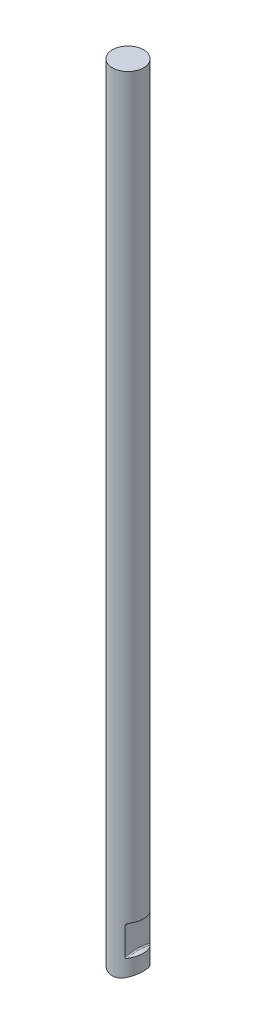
ISO-10303-21;
HEADER;
FILE_DESCRIPTION(('STEP AP214'),'2;1');
FILE_NAME('part.step','',(''),(''),'','','');
FILE_SCHEMA(('AUTOMOTIVE_DESIGN { 1 0 10303 214 1 1 1 1 }'));
ENDSEC;
DATA;
#1=APPLICATION_CONTEXT('core data for automotive mechanical design processes');
#2=APPLICATION_PROTOCOL_DEFINITION('international standard','automotive_design',2000,#1);
#3=PRODUCT_CONTEXT('',#1,'mechanical');
#4=PRODUCT('Part','Part','',(#3));
#5=PRODUCT_RELATED_PRODUCT_CATEGORY('part','',(#4));
#6=PRODUCT_DEFINITION_FORMATION('','',#4);
#7=PRODUCT_DEFINITION_CONTEXT('part definition',#1,'design');
#8=PRODUCT_DEFINITION('design','',#6,#7);
#9=PRODUCT_DEFINITION_SHAPE('','',#8);
#10=(LENGTH_UNIT() NAMED_UNIT(*) SI_UNIT(.MILLI.,.METRE.));
#11=(NAMED_UNIT(*) PLANE_ANGLE_UNIT() SI_UNIT($,.RADIAN.));
#12=(NAMED_UNIT(*) SI_UNIT($,.STERADIAN.) SOLID_ANGLE_UNIT());
#13=UNCERTAINTY_MEASURE_WITH_UNIT(LENGTH_MEASURE(1.E-05),#10,'distance_accuracy_value','');
#14=(GEOMETRIC_REPRESENTATION_CONTEXT(3) GLOBAL_UNCERTAINTY_ASSIGNED_CONTEXT((#13)) GLOBAL_UNIT_ASSIGNED_CONTEXT((#10,
#11,#12)) REPRESENTATION_CONTEXT('',''));
#15=CARTESIAN_POINT('',(0.,0.,0.));
#16=DIRECTION('',(0.,0.,1.));
#17=DIRECTION('',(1.,0.,0.));
#18=AXIS2_PLACEMENT_3D('',#15,#16,#17);
#19=CARTESIAN_POINT('',(3.762,0.,0.));
#20=DIRECTION('',(1.,0.,0.));
#21=DIRECTION('',(0.,0.,-1.));
#22=AXIS2_PLACEMENT_3D('',#19,#20,#21);
#23=TOROIDAL_SURFACE('',#22,23.738,0.762);
#24=CARTESIAN_POINT('',(3.0388592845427,23.159873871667,3.97055843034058));
#25=CARTESIAN_POINT('',(3.03333975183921,23.1760017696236,3.97478226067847));
#26=CARTESIAN_POINT('',(3.02838607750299,23.1924313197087,3.97855591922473));
#27=CARTESIAN_POINT('',(3.01964656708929,23.2257716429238,3.98519326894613));
#28=CARTESIAN_POINT('',(3.01586034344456,23.2426822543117,3.98805726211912));
#29=CARTESIAN_POINT('',(3.0063373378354,23.2937797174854,3.99524743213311));
#30=CARTESIAN_POINT('',(3.00237440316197,23.3285134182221,3.99821870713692));
#31=CARTESIAN_POINT('',(2.999213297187,23.3982545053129,4.00059027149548));
#32=CARTESIAN_POINT('',(3.00001116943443,23.4332616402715,3.99999352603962));
#33=CARTESIAN_POINT('',(3.00607576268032,23.5026797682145,3.99543765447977));
#34=CARTESIAN_POINT('',(3.0113463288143,23.5370902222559,3.99147563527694));
#35=CARTESIAN_POINT('',(3.0262367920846,23.6060418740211,3.98019860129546));
#36=CARTESIAN_POINT('',(3.03604236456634,23.6405187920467,3.97274023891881));
#37=CARTESIAN_POINT('',(3.05942064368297,23.7073154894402,3.95476445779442));
#38=CARTESIAN_POINT('',(3.07299456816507,23.7396345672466,3.9442460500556));
#39=CARTESIAN_POINT('',(3.10558877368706,23.8064503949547,3.9186488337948));
#40=CARTESIAN_POINT('',(3.12512499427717,23.8405213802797,3.90311809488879));
#41=CARTESIAN_POINT('',(3.16740170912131,23.9048519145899,3.86888986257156));
#42=CARTESIAN_POINT('',(3.19014416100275,23.9351091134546,3.85019043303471));
#43=CARTESIAN_POINT('',(3.24927153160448,24.0049923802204,3.80056981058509));
#44=CARTESIAN_POINT('',(3.28703729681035,24.0423200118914,3.76804015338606));
#45=CARTESIAN_POINT('',(3.36547276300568,24.108501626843,3.6981576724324));
#46=CARTESIAN_POINT('',(3.40614908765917,24.1373354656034,3.66079368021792));
#47=CARTESIAN_POINT('',(3.50091515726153,24.1942909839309,3.57057821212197));
#48=CARTESIAN_POINT('',(3.55540550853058,24.2196657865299,3.5164197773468));
#49=CARTESIAN_POINT('',(3.66367085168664,24.2581231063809,3.40347447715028));
#50=CARTESIAN_POINT('',(3.71744648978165,24.271217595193,3.34469218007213));
#51=CARTESIAN_POINT('',(3.78262610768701,24.2806399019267,3.26988003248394));
#52=CARTESIAN_POINT('',(3.79513761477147,24.282144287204,3.25535136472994));
#53=CARTESIAN_POINT('',(3.8075704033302,24.2833433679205,3.24074183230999));
#54=B_SPLINE_CURVE_WITH_KNOTS('',3,(#24,#25,#26,#27,#28,#29,#30,#31,#32,#33,#34,#35,#36,#37,#38,
#39,#40,#41,#42,#43,#44,#45,#46,#47,#48,#49,#50,#51,#52,#53),.UNSPECIFIED.,.F.,.F.,(4,2,2,2,2,2,
2,2,2,2,2,2,2,2,4),(0.,0.0526501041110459,0.105282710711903,0.209964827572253,0.314559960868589,
0.419245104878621,0.528658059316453,0.638106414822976,0.764334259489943,0.890639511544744,
1.07642718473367,1.26265200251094,1.50410161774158,1.7453156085,1.80299812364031),.UNSPECIFIED.);
#55=CARTESIAN_POINT('',(3.,23.3985607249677,4.));
#56=VERTEX_POINT('',#55);
#57=CARTESIAN_POINT('',(3.762,24.2776161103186,3.29353245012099));
#58=VERTEX_POINT('',#57);
#59=EDGE_CURVE('E168',#56,#58,#54,.T.);
#60=ORIENTED_EDGE('',*,*,#59,.F.);
#61=CARTESIAN_POINT('',(3.,0.,0.));
#62=DIRECTION('',(1.,0.,0.));
#63=DIRECTION('',(0.,0.,-1.));
#64=AXIS2_PLACEMENT_3D('',#61,#62,#63);
#65=CIRCLE('',#64,23.738);
#66=CARTESIAN_POINT('',(3.,23.3985607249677,-4.));
#67=VERTEX_POINT('',#66);
#68=EDGE_CURVE('E250',#67,#56,#65,.T.);
#69=ORIENTED_EDGE('',*,*,#68,.F.);
#70=CARTESIAN_POINT('',(3.8075704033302,24.2833433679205,-3.24074183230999));
#71=CARTESIAN_POINT('',(3.77940551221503,24.2806242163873,-3.27384144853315));
#72=CARTESIAN_POINT('',(3.7508528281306,24.2763420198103,-3.30650560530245));
#73=CARTESIAN_POINT('',(3.69316902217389,24.2644414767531,-3.37080962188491));
#74=CARTESIAN_POINT('',(3.66403687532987,24.2568166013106,-3.40244734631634));
#75=CARTESIAN_POINT('',(3.60523833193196,24.2379445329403,-3.46469457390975));
#76=CARTESIAN_POINT('',(3.57556948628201,24.2266651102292,-3.49529214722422));
#77=CARTESIAN_POINT('',(3.51634962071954,24.2002991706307,-3.55486270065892));
#78=CARTESIAN_POINT('',(3.48679851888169,24.1852160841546,-3.58383711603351));
#79=CARTESIAN_POINT('',(3.41688543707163,24.1443994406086,-3.65075944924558));
#80=CARTESIAN_POINT('',(3.37675896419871,24.1168025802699,-3.68784791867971));
#81=CARTESIAN_POINT('',(3.2992104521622,24.053485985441,-3.75738091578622));
#82=CARTESIAN_POINT('',(3.26177904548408,24.0177963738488,-3.7898419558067));
#83=CARTESIAN_POINT('',(3.19827205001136,23.9457666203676,-3.84349375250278));
#84=CARTESIAN_POINT('',(3.17139439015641,23.9108592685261,-3.86565239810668));
#85=CARTESIAN_POINT('',(3.12199328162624,23.8358227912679,-3.90565840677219));
#86=CARTESIAN_POINT('',(3.09946754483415,23.7956964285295,-3.92350803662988));
#87=CARTESIAN_POINT('',(3.06371522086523,23.7182819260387,-3.9514647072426));
#88=CARTESIAN_POINT('',(3.04955193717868,23.6817196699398,-3.96237920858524));
#89=CARTESIAN_POINT('',(3.0261164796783,23.6061231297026,-3.98030631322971));
#90=CARTESIAN_POINT('',(3.01684285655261,23.5670895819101,-3.98732007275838));
#91=CARTESIAN_POINT('',(3.00395703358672,23.4872387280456,-3.99703767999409));
#92=CARTESIAN_POINT('',(3.00038859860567,23.4464100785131,-3.99970821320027));
#93=CARTESIAN_POINT('',(2.99967350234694,23.364677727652,-4.00024521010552));
#94=CARTESIAN_POINT('',(3.00251523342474,23.3237742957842,-3.99812035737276));
#95=CARTESIAN_POINT('',(3.01186195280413,23.2624416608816,-3.99107767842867));
#96=CARTESIAN_POINT('',(3.0160205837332,23.2414163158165,-3.98793957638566));
#97=CARTESIAN_POINT('',(3.02611864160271,23.2000661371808,-3.98028190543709));
#98=CARTESIAN_POINT('',(3.03205732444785,23.1797410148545,-3.97576291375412));
#99=CARTESIAN_POINT('',(3.0388592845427,23.159873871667,-3.97055843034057));
#100=B_SPLINE_CURVE_WITH_KNOTS('',3,(#70,#71,#72,#73,#74,#75,#76,#77,#78,#79,#80,#81,#82,#83,
#84,#85,#86,#87,#88,#89,#90,#91,#92,#93,#94,#95,#96,#97,#98,#99),.UNSPECIFIED.,.F.,.F.,(4,2,2,2,
2,2,2,2,2,2,2,2,2,2,4),(0.,0.130631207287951,0.261518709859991,0.393593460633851,
0.525549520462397,0.708501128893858,0.890782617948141,1.03816490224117,1.18546948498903,
1.30707871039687,1.42865187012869,1.55115322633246,1.6734329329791,1.73830126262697,
1.80314251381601),.UNSPECIFIED.);
#101=CARTESIAN_POINT('',(3.76200000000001,24.2776161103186,-3.293532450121));
#102=VERTEX_POINT('',#101);
#103=EDGE_CURVE('E152',#102,#67,#100,.T.);
#104=ORIENTED_EDGE('',*,*,#103,.F.);
#105=CARTESIAN_POINT('',(3.762,0.,0.));
#106=DIRECTION('',(1.,0.,0.));
#107=DIRECTION('',(0.,0.,-1.));
#108=AXIS2_PLACEMENT_3D('',#105,#106,#107);
#109=CIRCLE('',#108,24.5);
#110=EDGE_CURVE('E247',#58,#102,#109,.F.);
#111=ORIENTED_EDGE('',*,*,#110,.F.);
#112=EDGE_LOOP('',(#60,#69,#104,#111));
#113=FACE_BOUND('',#112,.T.);
#114=ADVANCED_FACE('F38',(#113),#23,.F.);
#115=CARTESIAN_POINT('',(-8.84822894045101,0.,0.));
#116=DIRECTION('',(-1.,0.,0.));
#117=DIRECTION('',(0.,0.,1.));
#118=AXIS2_PLACEMENT_3D('',#115,#116,#117);
#119=CYLINDRICAL_SURFACE('',#118,24.5);
#120=ORIENTED_EDGE('',*,*,#110,.T.);
#121=CARTESIAN_POINT('',(3.762,24.2776161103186,-3.29353245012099));
#122=CARTESIAN_POINT('',(3.8539910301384,24.291872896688,-3.18847625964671));
#123=CARTESIAN_POINT('',(3.94157437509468,24.30595305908,-3.07953574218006));
#124=CARTESIAN_POINT('',(4.1073669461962,24.3333875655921,-2.85464858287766));
#125=CARTESIAN_POINT('',(4.18557579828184,24.3467418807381,-2.73870166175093));
#126=CARTESIAN_POINT('',(4.33205774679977,24.3723517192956,-2.50056534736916));
#127=CARTESIAN_POINT('',(4.40033022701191,24.3846071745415,-2.37837556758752));
#128=CARTESIAN_POINT('',(4.52643812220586,24.4076790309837,-2.12859756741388));
#129=CARTESIAN_POINT('',(4.58427390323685,24.4184954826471,-2.00100953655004));
#130=CARTESIAN_POINT('',(4.68911932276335,24.4383957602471,-1.74120612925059));
#131=CARTESIAN_POINT('',(4.73612010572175,24.4474781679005,-1.60898706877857));
#132=CARTESIAN_POINT('',(4.81888610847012,24.463646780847,-1.34090381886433));
#133=CARTESIAN_POINT('',(4.85464719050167,24.470732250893,-1.20503830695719));
#134=CARTESIAN_POINT('',(4.9145966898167,24.4826958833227,-0.930816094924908));
#135=CARTESIAN_POINT('',(4.93879601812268,24.4875761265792,-0.792461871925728));
#136=CARTESIAN_POINT('',(4.97548170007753,24.4950014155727,-0.51409747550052));
#137=CARTESIAN_POINT('',(4.98796404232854,24.497545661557,-0.374086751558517));
#138=CARTESIAN_POINT('',(5.00100997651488,24.50020532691,-0.0953827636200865));
#139=CARTESIAN_POINT('',(5.00173207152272,24.5003530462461,0.0433027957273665));
#140=CARTESIAN_POINT('',(4.9916576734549,24.4982983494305,0.32023730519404));
#141=CARTESIAN_POINT('',(4.98086121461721,24.4960959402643,0.458486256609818));
#142=CARTESIAN_POINT('',(4.94782509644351,24.4893999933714,0.733649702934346));
#143=CARTESIAN_POINT('',(4.92557757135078,24.4849048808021,0.87056321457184));
#144=CARTESIAN_POINT('',(4.86982120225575,24.4737494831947,1.14193842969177));
#145=CARTESIAN_POINT('',(4.8363161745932,24.4670899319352,1.27640094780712));
#146=CARTESIAN_POINT('',(4.75843478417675,24.4518148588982,1.54153344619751));
#147=CARTESIAN_POINT('',(4.71409517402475,24.4432059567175,1.6722146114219));
#148=CARTESIAN_POINT('',(4.61483875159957,24.4242577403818,1.92931170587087));
#149=CARTESIAN_POINT('',(4.55992575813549,24.4139190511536,2.05572915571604));
#150=CARTESIAN_POINT('',(4.43998004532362,24.3918009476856,2.30336427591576));
#151=CARTESIAN_POINT('',(4.37495815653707,24.3800230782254,2.42458733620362));
#152=CARTESIAN_POINT('',(4.23523436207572,24.3553379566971,2.66113628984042));
#153=CARTESIAN_POINT('',(4.16053695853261,24.3424312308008,2.77646489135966));
#154=CARTESIAN_POINT('',(4.0315229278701,24.320788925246,2.95875648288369));
#155=CARTESIAN_POINT('',(3.97998199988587,24.31229091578,3.02773011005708));
#156=CARTESIAN_POINT('',(3.87351305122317,24.2950890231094,3.1627961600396));
#157=CARTESIAN_POINT('',(3.81859083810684,24.2863855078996,3.22889320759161));
#158=CARTESIAN_POINT('',(3.76200000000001,24.2776161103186,3.293532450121));
#159=B_SPLINE_CURVE_WITH_KNOTS('',3,(#121,#122,#123,#124,#125,#126,#127,#128,#129,#130,#131,
#132,#133,#134,#135,#136,#137,#138,#139,#140,#141,#142,#143,#144,#145,#146,#147,#148,#149,#150,
#151,#152,#153,#154,#155,#156,#157,#158),.UNSPECIFIED.,.F.,.F.,(4,2,2,2,2,2,2,2,2,2,2,2,2,2,2,2,
2,2,4),(0.,0.420975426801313,0.84196764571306,1.26298596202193,1.68398950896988,
2.10533593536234,2.52683729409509,2.94794008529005,3.36918699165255,3.78475161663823,
4.20031500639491,4.61616422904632,5.03187261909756,5.44618997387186,5.86035796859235,
6.27408524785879,6.68762070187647,6.94708129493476,7.20610805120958),.UNSPECIFIED.);
#160=EDGE_CURVE('E160',#102,#58,#159,.T.);
#161=ORIENTED_EDGE('',*,*,#160,.T.);
#162=EDGE_LOOP('',(#120,#161));
#163=FACE_BOUND('',#162,.T.);
#164=ADVANCED_FACE('F134',(#163),#119,.F.);
#165=CARTESIAN_POINT('',(3.381,0.,0.));
#166=DIRECTION('',(1.,0.,0.));
#167=DIRECTION('',(0.,0.,-1.));
#168=AXIS2_PLACEMENT_3D('',#165,#166,#167);
#169=TOROIDAL_SURFACE('',#168,15.381,0.381);
#170=CARTESIAN_POINT('',(3.40598849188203,14.5473491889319,3.66049756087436));
#171=CARTESIAN_POINT('',(3.38315920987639,14.5404821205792,3.68175481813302));
#172=CARTESIAN_POINT('',(3.35969097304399,14.5355589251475,3.70317811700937));
#173=CARTESIAN_POINT('',(3.31181743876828,14.5304449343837,3.74604835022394));
#174=CARTESIAN_POINT('',(3.28740463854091,14.5303071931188,3.76749291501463));
#175=CARTESIAN_POINT('',(3.24501266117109,14.5350705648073,3.80400582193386));
#176=CARTESIAN_POINT('',(3.22704805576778,14.5386421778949,3.81925401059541));
#177=CARTESIAN_POINT('',(3.19158276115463,14.5493353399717,3.84893863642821));
#178=CARTESIAN_POINT('',(3.17408054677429,14.5564431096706,3.86337798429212));
#179=CARTESIAN_POINT('',(3.14333064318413,14.5728882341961,3.88841741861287));
#180=CARTESIAN_POINT('',(3.12990088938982,14.5815569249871,3.89922949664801));
#181=CARTESIAN_POINT('',(3.10421754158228,14.6016141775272,3.91970696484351));
#182=CARTESIAN_POINT('',(3.09196394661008,14.6130027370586,3.9293723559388));
#183=CARTESIAN_POINT('',(3.06911138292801,14.6385326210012,3.94724816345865));
#184=CARTESIAN_POINT('',(3.05852593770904,14.6526945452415,3.95544675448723));
#185=CARTESIAN_POINT('',(3.03970578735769,14.6833648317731,3.9699283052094));
#186=CARTESIAN_POINT('',(3.03146919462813,14.6998712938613,3.97621280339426));
#187=CARTESIAN_POINT('',(3.01866613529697,14.7323180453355,3.98593914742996));
#188=CARTESIAN_POINT('',(3.01375910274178,14.7480464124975,3.98964642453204));
#189=CARTESIAN_POINT('',(3.00614664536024,14.7803165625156,3.99538549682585));
#190=CARTESIAN_POINT('',(3.00344114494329,14.796858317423,3.99741734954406));
#191=CARTESIAN_POINT('',(3.00022654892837,14.8300894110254,3.99983056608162));
#192=CARTESIAN_POINT('',(2.99969511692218,14.8467754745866,4.00022871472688));
#193=CARTESIAN_POINT('',(3.00063469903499,14.8800524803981,3.99952391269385));
#194=CARTESIAN_POINT('',(3.00210618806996,14.8966433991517,3.99842060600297));
#195=CARTESIAN_POINT('',(3.00714220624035,14.9313393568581,3.99463474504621));
#196=CARTESIAN_POINT('',(3.01093296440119,14.9493924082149,3.99178139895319));
#197=CARTESIAN_POINT('',(3.02047833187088,14.9846532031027,3.98456348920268));
#198=CARTESIAN_POINT('',(3.0262343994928,15.0018603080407,3.98019780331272));
#199=CARTESIAN_POINT('',(3.04243829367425,15.0428505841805,3.96783502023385));
#200=CARTESIAN_POINT('',(3.05382776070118,15.0660398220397,3.95909035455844));
#201=CARTESIAN_POINT('',(3.0793422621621,15.1097719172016,3.93927817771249));
#202=CARTESIAN_POINT('',(3.0934721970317,15.1303099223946,3.92820650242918));
#203=CARTESIAN_POINT('',(3.12756592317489,15.173305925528,3.90114257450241));
#204=CARTESIAN_POINT('',(3.14810611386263,15.194967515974,3.88461163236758));
#205=CARTESIAN_POINT('',(3.19133924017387,15.2337047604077,3.84917350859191));
#206=CARTESIAN_POINT('',(3.2140343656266,15.2507756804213,3.83026390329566));
#207=CARTESIAN_POINT('',(3.26103377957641,15.280455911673,3.79033270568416));
#208=CARTESIAN_POINT('',(3.28535444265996,15.2930076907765,3.76928797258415));
#209=CARTESIAN_POINT('',(3.33463108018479,15.313286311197,3.72576317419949));
#210=CARTESIAN_POINT('',(3.35958569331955,15.3210227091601,3.70328605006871));
#211=CARTESIAN_POINT('',(3.39170627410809,15.3278056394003,3.6737480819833));
#212=CARTESIAN_POINT('',(3.39885009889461,15.3291125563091,3.66714013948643));
#213=CARTESIAN_POINT('',(3.4059884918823,15.3302166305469,3.66049756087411));
#214=B_SPLINE_CURVE_WITH_KNOTS('',3,(#170,#171,#172,#173,#174,#175,#176,#177,#178,#179,#180,
#181,#182,#183,#184,#185,#186,#187,#188,#189,#190,#191,#192,#193,#194,#195,#196,#197,#198,#199,
#200,#201,#202,#203,#204,#205,#206,#207,#208,#209,#210,#211,#212,#213),.UNSPECIFIED.,.F.,.F.,(4,
2,2,2,2,2,2,2,2,2,2,2,2,2,2,2,2,2,2,2,2,4),(0.,0.0959972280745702,0.193058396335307,
0.26432258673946,0.335311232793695,0.392978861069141,0.450646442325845,0.508759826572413,
0.566826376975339,0.617242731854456,0.667657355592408,0.717552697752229,0.767459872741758,
0.823248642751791,0.879078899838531,0.96045715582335,1.04198229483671,1.14381807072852,
1.24575846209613,1.34895421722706,1.45194451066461,1.48139123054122),.UNSPECIFIED.);
#215=CARTESIAN_POINT('',(3.381,14.5406726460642,3.68359050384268));
#216=VERTEX_POINT('',#215);
#217=CARTESIAN_POINT('',(2.99999999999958,14.8517729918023,4.00000000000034));
#218=VERTEX_POINT('',#217);
#219=EDGE_CURVE('E12',#216,#218,#214,.T.);
#220=ORIENTED_EDGE('',*,*,#219,.F.);
#221=CARTESIAN_POINT('',(3.381,0.,0.));
#222=DIRECTION('',(1.,0.,0.));
#223=DIRECTION('',(0.,0.,-1.));
#224=AXIS2_PLACEMENT_3D('',#221,#222,#223);
#225=CIRCLE('',#224,15.);
#226=CARTESIAN_POINT('',(3.38100000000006,14.5406726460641,-3.68359050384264));
#227=VERTEX_POINT('',#226);
#228=EDGE_CURVE('E113',#227,#216,#225,.T.);
#229=ORIENTED_EDGE('',*,*,#228,.F.);
#230=CARTESIAN_POINT('',(3.40598849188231,15.3302166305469,-3.66049756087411));
#231=CARTESIAN_POINT('',(3.37748333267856,15.3257810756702,-3.68704479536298));
#232=CARTESIAN_POINT('',(3.34888610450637,15.3181530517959,-3.71300840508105));
#233=CARTESIAN_POINT('',(3.29221130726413,15.2965210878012,-3.76334260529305));
#234=CARTESIAN_POINT('',(3.26414100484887,15.2824587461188,-3.78769621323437));
#235=CARTESIAN_POINT('',(3.20989288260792,15.248119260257,-3.83377904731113));
#236=CARTESIAN_POINT('',(3.18370817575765,15.2278663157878,-3.85551804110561));
#237=CARTESIAN_POINT('',(3.13450705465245,15.1812486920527,-3.89562099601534));
#238=CARTESIAN_POINT('',(3.11147747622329,15.154910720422,-3.91399909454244));
#239=CARTESIAN_POINT('',(3.07749970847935,15.106724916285,-3.9407218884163));
#240=CARTESIAN_POINT('',(3.06514970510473,15.0865509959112,-3.950323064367));
#241=CARTESIAN_POINT('',(3.04307837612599,15.0439543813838,-3.96735018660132));
#242=CARTESIAN_POINT('',(3.03335431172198,15.0215340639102,-3.97477839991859));
#243=CARTESIAN_POINT('',(3.01874813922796,14.9792159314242,-3.9858785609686));
#244=CARTESIAN_POINT('',(3.01330070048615,14.9596300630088,-3.98999311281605));
#245=CARTESIAN_POINT('',(3.00502544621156,14.919599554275,-3.99622942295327));
#246=CARTESIAN_POINT('',(3.00219494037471,14.8991558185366,-3.99835322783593));
#247=CARTESIAN_POINT('',(2.9997373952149,14.8610221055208,-4.00019716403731));
#248=CARTESIAN_POINT('',(2.99969678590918,14.8433744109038,-4.00022761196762));
#249=CARTESIAN_POINT('',(3.00197163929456,14.808312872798,-3.9985207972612));
#250=CARTESIAN_POINT('',(3.00428592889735,14.7908989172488,-3.99678441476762));
#251=CARTESIAN_POINT('',(3.01134440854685,14.7567790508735,-3.99146893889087));
#252=CARTESIAN_POINT('',(3.01609843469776,14.740076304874,-3.98788238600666));
#253=CARTESIAN_POINT('',(3.02792922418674,14.7080341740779,-3.97890678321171));
#254=CARTESIAN_POINT('',(3.03500551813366,14.6926945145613,-3.97351809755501));
#255=CARTESIAN_POINT('',(3.05061829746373,14.6648808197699,-3.96154229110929));
#256=CARTESIAN_POINT('',(3.05901763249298,14.6522812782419,-3.95506567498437));
#257=CARTESIAN_POINT('',(3.07724252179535,14.6289375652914,-3.9409023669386));
#258=CARTESIAN_POINT('',(3.0870683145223,14.6181937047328,-3.93321547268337));
#259=CARTESIAN_POINT('',(3.10834437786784,14.5981530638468,-3.91642541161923));
#260=CARTESIAN_POINT('',(3.1198534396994,14.5889644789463,-3.90726847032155));
#261=CARTESIAN_POINT('',(3.14366903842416,14.5727565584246,-3.88813313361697));
#262=CARTESIAN_POINT('',(3.15597575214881,14.5657377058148,-3.87815455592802));
#263=CARTESIAN_POINT('',(3.18751176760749,14.5506786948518,-3.85231973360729));
#264=CARTESIAN_POINT('',(3.20705479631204,14.5439604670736,-3.83607339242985));
#265=CARTESIAN_POINT('',(3.24649882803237,14.5346519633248,-3.80275149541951));
#266=CARTESIAN_POINT('',(3.26640103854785,14.5320802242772,-3.78567256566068));
#267=CARTESIAN_POINT('',(3.30670448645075,14.530495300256,-3.75052571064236));
#268=CARTESIAN_POINT('',(3.32709789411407,14.5316135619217,-3.73244431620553));
#269=CARTESIAN_POINT('',(3.36712551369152,14.5371642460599,-3.69637610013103));
#270=CARTESIAN_POINT('',(3.386765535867,14.5415608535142,-3.67839035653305));
#271=CARTESIAN_POINT('',(3.40598849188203,14.5473491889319,-3.66049756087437));
#272=B_SPLINE_CURVE_WITH_KNOTS('',3,(#230,#231,#232,#233,#234,#235,#236,#237,#238,#239,#240,
#241,#242,#243,#244,#245,#246,#247,#248,#249,#250,#251,#252,#253,#254,#255,#256,#257,#258,#259,
#260,#261,#262,#263,#264,#265,#266,#267,#268,#269,#270,#271),.UNSPECIFIED.,.F.,.F.,(4,2,2,2,2,2,
2,2,2,2,2,2,2,2,2,2,2,2,2,2,4),(0.,0.117535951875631,0.236160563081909,0.354327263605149,
0.471984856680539,0.548301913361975,0.624539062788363,0.686524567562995,0.748446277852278,
0.801165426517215,0.853858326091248,0.906765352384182,0.959661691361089,1.008849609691,
1.05804576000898,1.10987437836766,1.16171452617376,1.24013789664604,1.31891089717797,
1.40051984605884,1.48125006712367),.UNSPECIFIED.);
#273=CARTESIAN_POINT('',(3.,14.8517729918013,-4.));
#274=VERTEX_POINT('',#273);
#275=EDGE_CURVE('E52',#274,#227,#272,.T.);
#276=ORIENTED_EDGE('',*,*,#275,.F.);
#277=CARTESIAN_POINT('',(3.,0.,0.));
#278=DIRECTION('',(1.,0.,0.));
#279=DIRECTION('',(0.,0.,-1.));
#280=AXIS2_PLACEMENT_3D('',#277,#278,#279);
#281=CIRCLE('',#280,15.381);
#282=EDGE_CURVE('E119',#218,#274,#281,.F.);
#283=ORIENTED_EDGE('',*,*,#282,.F.);
#284=EDGE_LOOP('',(#220,#229,#276,#283));
#285=FACE_BOUND('',#284,.T.);
#286=ADVANCED_FACE('F40',(#285),#169,.F.);
#287=CARTESIAN_POINT('',(-8.84822894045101,0.,0.));
#288=DIRECTION('',(-1.,0.,0.));
#289=DIRECTION('',(0.,0.,1.));
#290=AXIS2_PLACEMENT_3D('',#287,#288,#289);
#291=CYLINDRICAL_SURFACE('',#290,15.);
#292=ORIENTED_EDGE('',*,*,#228,.T.);
#293=CARTESIAN_POINT('',(3.381,14.5406726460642,3.68359050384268));
#294=CARTESIAN_POINT('',(3.48402834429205,14.5646307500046,3.58903687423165));
#295=CARTESIAN_POINT('',(3.58306636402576,14.5886933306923,3.49016026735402));
#296=CARTESIAN_POINT('',(3.7725728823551,14.6363888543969,3.28439294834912));
#297=CARTESIAN_POINT('',(3.86304038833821,14.6600217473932,3.17750131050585));
#298=CARTESIAN_POINT('',(4.03490626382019,14.706243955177,2.95621197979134));
#299=CARTESIAN_POINT('',(4.11629250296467,14.7288318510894,2.84180456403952));
#300=CARTESIAN_POINT('',(4.26928246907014,14.7723184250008,2.60632652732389));
#301=CARTESIAN_POINT('',(4.3408866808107,14.7932171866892,2.48525623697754));
#302=CARTESIAN_POINT('',(4.47386018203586,14.8327808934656,2.23705652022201));
#303=CARTESIAN_POINT('',(4.53521587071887,14.8514428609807,2.10991932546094));
#304=CARTESIAN_POINT('',(4.64709184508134,14.8859876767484,1.85053835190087));
#305=CARTESIAN_POINT('',(4.69760813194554,14.9018694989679,1.71829270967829));
#306=CARTESIAN_POINT('',(4.78726872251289,14.9303762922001,1.44984729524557));
#307=CARTESIAN_POINT('',(4.82642759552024,14.9430054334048,1.31365283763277));
#308=CARTESIAN_POINT('',(4.89310041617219,14.9646729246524,1.0381071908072));
#309=CARTESIAN_POINT('',(4.92061030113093,14.9737100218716,0.898754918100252));
#310=CARTESIAN_POINT('',(4.96296923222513,14.9876842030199,0.622717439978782));
#311=CARTESIAN_POINT('',(4.9782108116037,14.9927482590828,0.486098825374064));
#312=CARTESIAN_POINT('',(4.99739339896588,14.999128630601,0.211984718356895));
#313=CARTESIAN_POINT('',(5.00133453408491,15.0004449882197,0.0744892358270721));
#314=CARTESIAN_POINT('',(4.99787353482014,14.9992910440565,-0.20033833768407));
#315=CARTESIAN_POINT('',(4.99047242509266,14.9968210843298,-0.337670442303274));
#316=CARTESIAN_POINT('',(4.96441660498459,14.9881720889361,-0.611110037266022));
#317=CARTESIAN_POINT('',(4.9457619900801,14.9819930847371,-0.74721753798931));
#318=CARTESIAN_POINT('',(4.87450091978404,14.9585638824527,-1.14461455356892));
#319=CARTESIAN_POINT('',(4.80646557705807,14.9363677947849,-1.40301437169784));
#320=CARTESIAN_POINT('',(4.6306293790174,14.8807206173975,-1.9047399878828));
#321=CARTESIAN_POINT('',(4.52280140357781,14.8472618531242,-2.14805537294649));
#322=CARTESIAN_POINT('',(4.33076976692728,14.7902545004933,-2.50274951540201));
#323=CARTESIAN_POINT('',(4.25968604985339,14.769551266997,-2.6218840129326));
#324=CARTESIAN_POINT('',(4.10800408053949,14.7265203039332,-2.85367640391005));
#325=CARTESIAN_POINT('',(4.02740497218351,14.7041924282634,-2.96633371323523));
#326=CARTESIAN_POINT('',(3.85731962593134,14.6585200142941,-3.18436689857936));
#327=CARTESIAN_POINT('',(3.7678394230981,14.6351761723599,-3.28974763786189));
#328=CARTESIAN_POINT('',(3.58053540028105,14.5880784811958,-3.49268462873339));
#329=CARTESIAN_POINT('',(3.4827128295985,14.5643246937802,-3.59024204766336));
#330=CARTESIAN_POINT('',(3.381,14.5406726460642,-3.68359050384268));
#331=B_SPLINE_CURVE_WITH_KNOTS('',3,(#293,#294,#295,#296,#297,#298,#299,#300,#301,#302,#303,
#304,#305,#306,#307,#308,#309,#310,#311,#312,#313,#314,#315,#316,#317,#318,#319,#320,#321,#322,
#323,#324,#325,#326,#327,#328,#329,#330),.UNSPECIFIED.,.F.,.F.,(4,2,2,2,2,2,2,2,2,2,2,2,2,2,2,2,
2,2,4),(0.,0.425513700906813,0.851076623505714,1.27720135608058,1.70330496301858,
2.12996963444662,2.55679143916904,2.9830632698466,3.40948364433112,3.82164778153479,
4.23380728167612,4.64592954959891,5.0580483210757,5.8584905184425,6.65947925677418,
7.07986821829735,7.50029503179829,7.92043807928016,8.34051831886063),.UNSPECIFIED.);
#332=EDGE_CURVE('E107',#216,#227,#331,.T.);
#333=ORIENTED_EDGE('',*,*,#332,.T.);
#334=EDGE_LOOP('',(#292,#333));
#335=FACE_BOUND('',#334,.T.);
#336=ADVANCED_FACE('F116',(#335),#291,.T.);
#337=CARTESIAN_POINT('',(3.,15.,0.));
#338=DIRECTION('',(1.,0.,0.));
#339=DIRECTION('',(0.,0.,-1.));
#340=AXIS2_PLACEMENT_3D('',#337,#338,#339);
#341=PLANE('',#340);
#342=ORIENTED_EDGE('',*,*,#282,.T.);
#343=DIRECTION('',(0.,1.,0.));
#344=VECTOR('',#343,1.);
#345=CARTESIAN_POINT('',(3.,8.66025403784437,-4.));
#346=LINE('',#345,#344);
#347=EDGE_CURVE('E67',#274,#67,#346,.T.);
#348=ORIENTED_EDGE('',*,*,#347,.T.);
#349=ORIENTED_EDGE('',*,*,#68,.T.);
#350=DIRECTION('',(0.,1.,0.));
#351=VECTOR('',#350,1.);
#352=CARTESIAN_POINT('',(3.,8.66025403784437,4.));
#353=LINE('',#352,#351);
#354=EDGE_CURVE('E290',#56,#218,#353,.F.);
#355=ORIENTED_EDGE('',*,*,#354,.T.);
#356=EDGE_LOOP('',(#342,#348,#349,#355));
#357=FACE_BOUND('',#356,.T.);
#358=ADVANCED_FACE('F132',(#357),#341,.T.);
#359=CARTESIAN_POINT('',(0.,8.66025403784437,0.));
#360=DIRECTION('',(0.,1.,0.));
#361=DIRECTION('',(0.,0.,1.));
#362=AXIS2_PLACEMENT_3D('',#359,#360,#361);
#363=CYLINDRICAL_SURFACE('',#362,5.);
#364=CARTESIAN_POINT('',(0.,260.,0.));
#365=DIRECTION('',(0.,1.,0.));
#366=DIRECTION('',(0.,0.,1.));
#367=AXIS2_PLACEMENT_3D('',#364,#365,#366);
#368=CIRCLE('',#367,5.);
#369=CARTESIAN_POINT('',(0.,260.,5.));
#370=VERTEX_POINT('',#369);
#371=EDGE_CURVE('E117',#370,#370,#368,.T.);
#372=ORIENTED_EDGE('',*,*,#371,.F.);
#373=EDGE_LOOP('',(#372));
#374=FACE_BOUND('',#373,.T.);
#375=CARTESIAN_POINT('',(0.,8.66025403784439,5.));
#376=CARTESIAN_POINT('',(0.130331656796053,8.66025482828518,4.99999937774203));
#377=CARTESIAN_POINT('',(0.260674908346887,8.66320639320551,4.99489703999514));
#378=CARTESIAN_POINT('',(0.520355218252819,8.67490215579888,4.97455590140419));
#379=CARTESIAN_POINT('',(0.649691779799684,8.68364905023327,4.95931238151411));
#380=CARTESIAN_POINT('',(0.906513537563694,8.70662912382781,4.91885673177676));
#381=CARTESIAN_POINT('',(1.03399550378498,8.72087090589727,4.89362896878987));
#382=CARTESIAN_POINT('',(1.28601746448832,8.75432466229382,4.83352579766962));
#383=CARTESIAN_POINT('',(1.41055615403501,8.77353879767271,4.79864619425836));
#384=CARTESIAN_POINT('',(1.77711120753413,8.83745677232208,4.6805346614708));
#385=CARTESIAN_POINT('',(2.01373232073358,8.88859880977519,4.58356144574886));
#386=CARTESIAN_POINT('',(2.46716195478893,9.00213659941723,4.35632594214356));
#387=CARTESIAN_POINT('',(2.68396940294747,9.06453296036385,4.22606185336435));
#388=CARTESIAN_POINT('',(3.11151061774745,9.19984032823,3.92334549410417));
#389=CARTESIAN_POINT('',(3.32026858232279,9.27319410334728,3.74829976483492));
#390=CARTESIAN_POINT('',(3.70706905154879,9.41860822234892,3.36622943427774));
#391=CARTESIAN_POINT('',(3.8850962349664,9.49066790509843,3.15918897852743));
#392=CARTESIAN_POINT('',(4.1312264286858,9.59484443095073,2.82033206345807));
#393=CARTESIAN_POINT('',(4.2119131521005,9.62993554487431,2.69838192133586));
#394=CARTESIAN_POINT('',(4.36262866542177,9.69680156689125,2.44722131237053));
#395=CARTESIAN_POINT('',(4.43266169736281,9.72857779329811,2.31801376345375));
#396=CARTESIAN_POINT('',(4.56137623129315,9.78789520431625,2.05317391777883));
#397=CARTESIAN_POINT('',(4.62006065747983,9.81543747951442,1.91754328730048));
#398=CARTESIAN_POINT('',(4.72543101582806,9.86547242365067,1.64079696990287));
#399=CARTESIAN_POINT('',(4.77211822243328,9.88796562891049,1.49968186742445));
#400=CARTESIAN_POINT('',(4.85001551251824,9.92580359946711,1.22330436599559));
#401=CARTESIAN_POINT('',(4.88209010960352,9.94154295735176,1.08833937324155));
#402=CARTESIAN_POINT('',(4.93496642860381,9.96761571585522,0.815709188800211));
#403=CARTESIAN_POINT('',(4.95576924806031,9.97794964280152,0.678044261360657));
#404=CARTESIAN_POINT('',(4.98581991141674,9.99290900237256,0.401217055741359));
#405=CARTESIAN_POINT('',(4.99507333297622,9.99753719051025,0.262055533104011));
#406=CARTESIAN_POINT('',(5.00191433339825,10.0009568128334,-0.0166220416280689));
#407=CARTESIAN_POINT('',(4.99950262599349,9.99974860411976,-0.156138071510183));
#408=CARTESIAN_POINT('',(4.98376939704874,9.99189263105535,-0.422158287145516));
#409=CARTESIAN_POINT('',(4.97141822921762,9.9857287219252,-0.548735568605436));
#410=CARTESIAN_POINT('',(4.93716742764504,9.9687211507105,-0.80031234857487));
#411=CARTESIAN_POINT('',(4.91526477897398,9.95787601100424,-0.925311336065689));
#412=CARTESIAN_POINT('',(4.8621537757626,9.93176736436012,-1.17280363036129));
#413=CARTESIAN_POINT('',(4.83094853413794,9.91650533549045,-1.29529776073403));
#414=CARTESIAN_POINT('',(4.75955234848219,9.88192155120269,-1.53706747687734));
#415=CARTESIAN_POINT('',(4.71935796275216,9.86259824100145,-1.6563418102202));
#416=CARTESIAN_POINT('',(4.58462546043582,9.79859222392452,-2.01140340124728));
#417=CARTESIAN_POINT('',(4.4766310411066,9.74822622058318,-2.24122720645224));
#418=CARTESIAN_POINT('',(4.22867030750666,9.63687815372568,-2.67992393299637));
#419=CARTESIAN_POINT('',(4.08869254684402,9.57589229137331,-2.88878931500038));
#420=CARTESIAN_POINT('',(3.76553652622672,9.44222356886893,-3.30085071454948));
#421=CARTESIAN_POINT('',(3.57952539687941,9.36897995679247,-3.50164452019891));
#422=CARTESIAN_POINT('',(3.17701080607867,9.22270586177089,-3.87054772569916));
#423=CARTESIAN_POINT('',(2.96048410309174,9.14967558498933,-4.03863197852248));
#424=CARTESIAN_POINT('',(2.60880646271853,9.04390911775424,-4.2679539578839));
#425=CARTESIAN_POINT('',(2.48294906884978,9.00829977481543,-4.34240098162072));
#426=CARTESIAN_POINT('',(2.2244861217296,8.94051483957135,-4.48030007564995));
#427=CARTESIAN_POINT('',(2.09188344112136,8.90833780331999,-4.54375677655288));
#428=CARTESIAN_POINT('',(1.82079650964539,8.84860631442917,-4.65901104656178));
#429=CARTESIAN_POINT('',(1.68231588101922,8.82104906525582,-4.71081567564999));
#430=CARTESIAN_POINT('',(1.40037865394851,8.7716484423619,-4.80217514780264));
#431=CARTESIAN_POINT('',(1.25692273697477,8.74980428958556,-4.84173166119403));
#432=CARTESIAN_POINT('',(0.977743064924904,8.71426171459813,-4.90539138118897));
#433=CARTESIAN_POINT('',(0.84230626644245,8.7000553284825,-4.93047005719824));
#434=CARTESIAN_POINT('',(0.569328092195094,8.67788216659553,-4.96939299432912));
#435=CARTESIAN_POINT('',(0.431786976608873,8.66991462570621,-4.98323863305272));
#436=CARTESIAN_POINT('',(0.155884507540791,8.66056020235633,-4.99947854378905));
#437=CARTESIAN_POINT('',(0.0175236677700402,8.65916956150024,-5.00187935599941));
#438=CARTESIAN_POINT('',(-0.258820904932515,8.66301922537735,-4.99520900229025));
#439=CARTESIAN_POINT('',(-0.396804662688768,8.66825908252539,-4.98613861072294));
#440=CARTESIAN_POINT('',(-0.656088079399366,8.68421505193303,-4.95828928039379));
#441=CARTESIAN_POINT('',(-0.777556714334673,8.69426699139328,-4.94068517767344));
#442=CARTESIAN_POINT('',(-1.01841757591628,8.71910498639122,-4.89671673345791));
#443=CARTESIAN_POINT('',(-1.13780915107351,8.73389250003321,-4.87034969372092));
#444=CARTESIAN_POINT('',(-1.49171004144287,8.78469607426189,-4.77850297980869));
#445=CARTESIAN_POINT('',(-1.72211429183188,8.82716454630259,-4.7002591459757));
#446=CARTESIAN_POINT('',(-2.17709323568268,8.92681241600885,-4.50823244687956));
#447=CARTESIAN_POINT('',(-2.40090369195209,8.98458205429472,-4.392971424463));
#448=CARTESIAN_POINT('',(-2.82733774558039,9.10780608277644,-4.13143421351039));
#449=CARTESIAN_POINT('',(-3.02995037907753,9.1732644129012,-3.9851420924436));
#450=CARTESIAN_POINT('',(-3.43489140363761,9.31439795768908,-3.64419701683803));
#451=CARTESIAN_POINT('',(-3.63396448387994,9.39032093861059,-3.44577250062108));
#452=CARTESIAN_POINT('',(-3.99708246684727,9.53671997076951,-3.01697632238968));
#453=CARTESIAN_POINT('',(-4.16111553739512,9.60719417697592,-2.78659391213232));
#454=CARTESIAN_POINT('',(-4.37900947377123,9.7041941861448,-2.41774074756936));
#455=CARTESIAN_POINT('',(-4.44766209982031,9.73542921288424,-2.28903769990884));
#456=CARTESIAN_POINT('',(-4.57375651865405,9.79367711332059,-2.02535752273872));
#457=CARTESIAN_POINT('',(-4.63120327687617,9.82069185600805,-1.89038320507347));
#458=CARTESIAN_POINT('',(-4.73421790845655,9.86968940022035,-1.61516754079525));
#459=CARTESIAN_POINT('',(-4.7797914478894,9.89167460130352,-1.47492874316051));
#460=CARTESIAN_POINT('',(-4.85850907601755,9.92995088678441,-1.19024723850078));
#461=CARTESIAN_POINT('',(-4.89165463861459,9.94624264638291,-1.04580503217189));
#462=CARTESIAN_POINT('',(-4.94259503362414,9.97139931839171,-0.767401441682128));
#463=CARTESIAN_POINT('',(-4.96151960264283,9.98080865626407,-0.633694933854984));
#464=CARTESIAN_POINT('',(-4.98849345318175,9.99424478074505,-0.36492420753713));
#465=CARTESIAN_POINT('',(-4.99654357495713,9.9982719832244,-0.229860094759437));
#466=CARTESIAN_POINT('',(-5.00166317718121,10.0008314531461,0.0404881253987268));
#467=CARTESIAN_POINT('',(-4.99873585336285,9.999365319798,0.175772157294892));
#468=CARTESIAN_POINT('',(-4.98194745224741,9.99098333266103,0.445485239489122));
#469=CARTESIAN_POINT('',(-4.96808667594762,9.98406762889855,0.579914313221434));
#470=CARTESIAN_POINT('',(-4.93088232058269,9.96560870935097,0.838004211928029));
#471=CARTESIAN_POINT('',(-4.90822716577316,9.95440210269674,0.961788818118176));
#472=CARTESIAN_POINT('',(-4.85378684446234,9.92767317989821,1.20687032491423));
#473=CARTESIAN_POINT('',(-4.82199877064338,9.91214948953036,1.32816642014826));
#474=CARTESIAN_POINT('',(-4.71339175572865,9.859612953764,1.68709586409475));
#475=CARTESIAN_POINT('',(-4.62329807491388,9.81661817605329,1.91998814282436));
#476=CARTESIAN_POINT('',(-4.40635777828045,9.71629432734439,2.37715486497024));
#477=CARTESIAN_POINT('',(-4.27810403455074,9.65843082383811,2.60063468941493));
#478=CARTESIAN_POINT('',(-3.99020969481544,9.53440669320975,3.02386422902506));
#479=CARTESIAN_POINT('',(-3.83055468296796,9.46824226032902,3.22360297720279));
#480=CARTESIAN_POINT('',(-3.46602482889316,9.32643278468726,3.61456788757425));
#481=CARTESIAN_POINT('',(-3.25823096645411,9.25049954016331,3.80296860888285));
#482=CARTESIAN_POINT('',(-2.81270295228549,9.1031442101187,4.14333626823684));
#483=CARTESIAN_POINT('',(-2.57494259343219,9.03172615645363,4.29527097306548));
#484=CARTESIAN_POINT('',(-2.19578033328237,8.93341291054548,4.49442606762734));
#485=CARTESIAN_POINT('',(-2.06337367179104,8.90168698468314,4.55675683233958));
#486=CARTESIAN_POINT('',(-1.79274453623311,8.8428797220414,4.66985426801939));
#487=CARTESIAN_POINT('',(-1.65452510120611,8.81579599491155,4.72062689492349));
#488=CARTESIAN_POINT('',(-1.37359212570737,8.76742025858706,4.80987708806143));
#489=CARTESIAN_POINT('',(-1.23089120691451,8.74611337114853,4.8483862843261));
#490=CARTESIAN_POINT('',(-0.941907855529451,8.71014784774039,4.91270711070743));
#491=CARTESIAN_POINT('',(-0.79562800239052,8.69548456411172,4.93852761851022));
#492=CARTESIAN_POINT('',(-0.541002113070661,8.67647541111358,4.97182308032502));
#493=CARTESIAN_POINT('',(-0.433175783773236,8.67040719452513,4.98237929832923));
#494=CARTESIAN_POINT('',(-0.216902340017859,8.66229604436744,4.99646825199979));
#495=CARTESIAN_POINT('',(-0.10845518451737,8.66025338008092,5.00000051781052));
#496=CARTESIAN_POINT('',(0.,8.66025403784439,5.));
#497=B_SPLINE_CURVE_WITH_KNOTS('',3,(#375,#376,#377,#378,#379,#380,#381,#382,#383,#384,#385,
#386,#387,#388,#389,#390,#391,#392,#393,#394,#395,#396,#397,#398,#399,#400,#401,#402,#403,#404,
#405,#406,#407,#408,#409,#410,#411,#412,#413,#414,#415,#416,#417,#418,#419,#420,#421,#422,#423,
#424,#425,#426,#427,#428,#429,#430,#431,#432,#433,#434,#435,#436,#437,#438,#439,#440,#441,#442,
#443,#444,#445,#446,#447,#448,#449,#450,#451,#452,#453,#454,#455,#456,#457,#458,#459,#460,#461,
#462,#463,#464,#465,#466,#467,#468,#469,#470,#471,#472,#473,#474,#475,#476,#477,#478,#479,#480,
#481,#482,#483,#484,#485,#486,#487,#488,#489,#490,#491,#492,#493,#494,#495,#496),.UNSPECIFIED.,
.T.,.F.,(4,2,2,2,2,2,2,2,2,2,2,2,2,2,2,2,2,2,2,2,2,2,2,2,2,2,2,2,2,2,2,2,2,2,2,2,2,2,2,2,2,2,2,
2,2,2,2,2,2,2,2,2,2,2,2,2,2,2,2,2,4),(0.,0.390882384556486,0.781946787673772,1.17362595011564,
1.56547562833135,2.34415414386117,3.12287479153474,3.96582272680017,4.80918971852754,
5.25982992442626,5.71029022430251,6.16063429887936,6.61093051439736,7.02920538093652,
7.44743951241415,7.86547158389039,8.28347807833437,8.66500933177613,9.0466611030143,
9.42818530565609,9.80985583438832,10.5829669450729,11.3563551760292,12.2028497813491,
13.0499926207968,13.501002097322,13.9518210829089,14.4023661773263,14.8528498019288,
15.2676702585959,15.6824398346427,16.0969723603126,16.5114769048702,16.8804871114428,
17.2496110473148,17.9873544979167,18.7592666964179,19.5315761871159,20.4012390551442,
21.2711951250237,21.7182117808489,22.1650299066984,22.6116344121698,23.0581859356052,
23.4637505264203,23.8692837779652,24.2746989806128,24.6801030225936,25.0586722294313,
25.4373620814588,26.1940875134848,26.9831783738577,27.7726323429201,28.6406529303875,
29.5094379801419,29.9581473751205,30.4066250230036,30.8539364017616,31.3009343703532,
31.6261844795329,31.9514563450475),.UNSPECIFIED.);
#498=CARTESIAN_POINT('',(0.,8.66025403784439,5.));
#499=VERTEX_POINT('',#498);
#500=EDGE_CURVE('E205',#499,#499,#497,.T.);
#501=ORIENTED_EDGE('',*,*,#500,.T.);
#502=EDGE_LOOP('',(#501));
#503=FACE_BOUND('',#502,.T.);
#504=CARTESIAN_POINT('',(-3.03885928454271,23.159873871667,-3.97055843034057));
#505=CARTESIAN_POINT('',(-3.03333975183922,23.1760017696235,-3.97478226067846));
#506=CARTESIAN_POINT('',(-3.028386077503,23.1924313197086,-3.97855591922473));
#507=CARTESIAN_POINT('',(-3.0196465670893,23.2257716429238,-3.98519326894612));
#508=CARTESIAN_POINT('',(-3.01586034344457,23.2426822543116,-3.98805726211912));
#509=CARTESIAN_POINT('',(-3.0063373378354,23.2937797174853,-3.99524743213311));
#510=CARTESIAN_POINT('',(-3.00237440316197,23.3285134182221,-3.99821870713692));
#511=CARTESIAN_POINT('',(-2.999213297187,23.3982545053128,-4.00059027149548));
#512=CARTESIAN_POINT('',(-3.00001116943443,23.4332616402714,-3.99999352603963));
#513=CARTESIAN_POINT('',(-3.00607576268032,23.5026797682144,-3.99543765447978));
#514=CARTESIAN_POINT('',(-3.01134632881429,23.5370902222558,-3.99147563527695));
#515=CARTESIAN_POINT('',(-3.02623679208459,23.6060418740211,-3.98019860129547));
#516=CARTESIAN_POINT('',(-3.03604236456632,23.6405187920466,-3.97274023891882));
#517=CARTESIAN_POINT('',(-3.05942064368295,23.7073154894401,-3.95476445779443));
#518=CARTESIAN_POINT('',(-3.07299456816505,23.7396345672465,-3.94424605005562));
#519=CARTESIAN_POINT('',(-3.10558877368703,23.8064503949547,-3.91864883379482));
#520=CARTESIAN_POINT('',(-3.12512499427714,23.8405213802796,-3.90311809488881));
#521=CARTESIAN_POINT('',(-3.16740170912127,23.9048519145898,-3.86888986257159));
#522=CARTESIAN_POINT('',(-3.19014416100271,23.9351091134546,-3.85019043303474));
#523=CARTESIAN_POINT('',(-3.24927153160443,24.0049923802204,-3.80056981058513));
#524=CARTESIAN_POINT('',(-3.2870372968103,24.0423200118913,-3.7680401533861));
#525=CARTESIAN_POINT('',(-3.36547276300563,24.108501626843,-3.69815767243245));
#526=CARTESIAN_POINT('',(-3.40614908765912,24.1373354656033,-3.66079368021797));
#527=CARTESIAN_POINT('',(-3.50091515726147,24.1942909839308,-3.57057821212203));
#528=CARTESIAN_POINT('',(-3.55540550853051,24.2196657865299,-3.51641977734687));
#529=CARTESIAN_POINT('',(-3.66367085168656,24.2581231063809,-3.40347447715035));
#530=CARTESIAN_POINT('',(-3.71744648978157,24.271217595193,-3.34469218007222));
#531=CARTESIAN_POINT('',(-3.78262610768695,24.2806399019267,-3.269880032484));
#532=CARTESIAN_POINT('',(-3.79513761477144,24.282144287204,-3.25535136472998));
#533=CARTESIAN_POINT('',(-3.8075704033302,24.2833433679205,-3.24074183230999));
#534=B_SPLINE_CURVE_WITH_KNOTS('',3,(#504,#505,#506,#507,#508,#509,#510,#511,#512,#513,#514,
#515,#516,#517,#518,#519,#520,#521,#522,#523,#524,#525,#526,#527,#528,#529,#530,#531,#532,#533),
.UNSPECIFIED.,.F.,.F.,(4,2,2,2,2,2,2,2,2,2,2,2,2,2,4),(0.,0.0526501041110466,0.105282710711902,
0.209964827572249,0.314559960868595,0.419245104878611,0.528658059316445,0.638106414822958,
0.764334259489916,0.890639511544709,1.07642718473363,1.26265200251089,1.50410161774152,
1.74531560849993,1.80299812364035),.UNSPECIFIED.);
#535=CARTESIAN_POINT('',(-3.,23.3985607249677,-4.));
#536=VERTEX_POINT('',#535);
#537=CARTESIAN_POINT('',(-3.762,24.2776161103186,-3.29353245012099));
#538=VERTEX_POINT('',#537);
#539=EDGE_CURVE('E190',#536,#538,#534,.T.);
#540=ORIENTED_EDGE('',*,*,#539,.T.);
#541=CARTESIAN_POINT('',(-3.762,24.2776161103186,3.29353245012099));
#542=CARTESIAN_POINT('',(-3.85399103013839,24.291872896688,3.18847625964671));
#543=CARTESIAN_POINT('',(-3.94157437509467,24.30595305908,3.07953574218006));
#544=CARTESIAN_POINT('',(-4.1073669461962,24.3333875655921,2.85464858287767));
#545=CARTESIAN_POINT('',(-4.18557579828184,24.3467418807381,2.73870166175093));
#546=CARTESIAN_POINT('',(-4.33205774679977,24.3723517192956,2.50056534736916));
#547=CARTESIAN_POINT('',(-4.40033022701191,24.3846071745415,2.37837556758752));
#548=CARTESIAN_POINT('',(-4.52643812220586,24.4076790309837,2.12859756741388));
#549=CARTESIAN_POINT('',(-4.58427390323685,24.4184954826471,2.00100953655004));
#550=CARTESIAN_POINT('',(-4.68911932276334,24.4383957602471,1.7412061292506));
#551=CARTESIAN_POINT('',(-4.73612010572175,24.4474781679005,1.60898706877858));
#552=CARTESIAN_POINT('',(-4.81888610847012,24.463646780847,1.34090381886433));
#553=CARTESIAN_POINT('',(-4.85464719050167,24.470732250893,1.20503830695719));
#554=CARTESIAN_POINT('',(-4.9145966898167,24.4826958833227,0.93081609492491));
#555=CARTESIAN_POINT('',(-4.93879601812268,24.4875761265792,0.79246187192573));
#556=CARTESIAN_POINT('',(-4.97548170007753,24.4950014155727,0.514097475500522));
#557=CARTESIAN_POINT('',(-4.98796404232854,24.497545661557,0.374086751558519));
#558=CARTESIAN_POINT('',(-5.00100997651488,24.50020532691,0.0953827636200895));
#559=CARTESIAN_POINT('',(-5.00173207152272,24.5003530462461,-0.0433027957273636));
#560=CARTESIAN_POINT('',(-4.9916576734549,24.4982983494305,-0.320237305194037));
#561=CARTESIAN_POINT('',(-4.98086121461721,24.4960959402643,-0.458486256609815));
#562=CARTESIAN_POINT('',(-4.94782509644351,24.4893999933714,-0.733649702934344));
#563=CARTESIAN_POINT('',(-4.92557757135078,24.4849048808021,-0.870563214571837));
#564=CARTESIAN_POINT('',(-4.86982120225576,24.4737494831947,-1.14193842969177));
#565=CARTESIAN_POINT('',(-4.8363161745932,24.4670899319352,-1.27640094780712));
#566=CARTESIAN_POINT('',(-4.75843478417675,24.4518148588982,-1.5415334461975));
#567=CARTESIAN_POINT('',(-4.71409517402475,24.4432059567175,-1.6722146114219));
#568=CARTESIAN_POINT('',(-4.61483875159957,24.4242577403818,-1.92931170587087));
#569=CARTESIAN_POINT('',(-4.5599257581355,24.4139190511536,-2.05572915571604));
#570=CARTESIAN_POINT('',(-4.43998004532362,24.3918009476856,-2.30336427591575));
#571=CARTESIAN_POINT('',(-4.37495815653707,24.3800230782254,-2.42458733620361));
#572=CARTESIAN_POINT('',(-4.23523436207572,24.3553379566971,-2.66113628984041));
#573=CARTESIAN_POINT('',(-4.16053695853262,24.3424312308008,-2.77646489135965));
#574=CARTESIAN_POINT('',(-4.0315229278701,24.320788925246,-2.95875648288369));
#575=CARTESIAN_POINT('',(-3.97998199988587,24.31229091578,-3.02773011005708));
#576=CARTESIAN_POINT('',(-3.87351305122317,24.2950890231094,-3.1627961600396));
#577=CARTESIAN_POINT('',(-3.81859083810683,24.2863855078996,-3.22889320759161));
#578=CARTESIAN_POINT('',(-3.76200000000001,24.2776161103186,-3.293532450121));
#579=B_SPLINE_CURVE_WITH_KNOTS('',3,(#541,#542,#543,#544,#545,#546,#547,#548,#549,#550,#551,
#552,#553,#554,#555,#556,#557,#558,#559,#560,#561,#562,#563,#564,#565,#566,#567,#568,#569,#570,
#571,#572,#573,#574,#575,#576,#577,#578),.UNSPECIFIED.,.F.,.F.,(4,2,2,2,2,2,2,2,2,2,2,2,2,2,2,2,
2,2,4),(0.,0.420975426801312,0.84196764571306,1.26298596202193,1.68398950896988,
2.10533593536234,2.52683729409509,2.94794008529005,3.36918699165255,3.78475161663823,
4.20031500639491,4.61616422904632,5.03187261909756,5.44618997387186,5.86035796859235,
6.27408524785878,6.68762070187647,6.94708129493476,7.20610805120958),.UNSPECIFIED.);
#580=CARTESIAN_POINT('',(-3.762,24.2776161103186,3.29353245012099));
#581=VERTEX_POINT('',#580);
#582=EDGE_CURVE('E198',#581,#538,#579,.T.);
#583=ORIENTED_EDGE('',*,*,#582,.F.);
#584=CARTESIAN_POINT('',(-3.8075704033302,24.2833433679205,3.24074183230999));
#585=CARTESIAN_POINT('',(-3.77940551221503,24.2806242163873,3.27384144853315));
#586=CARTESIAN_POINT('',(-3.75085282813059,24.2763420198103,3.30650560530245));
#587=CARTESIAN_POINT('',(-3.69316902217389,24.2644414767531,3.37080962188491));
#588=CARTESIAN_POINT('',(-3.66403687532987,24.2568166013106,3.40244734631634));
#589=CARTESIAN_POINT('',(-3.60523833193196,24.2379445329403,3.46469457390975));
#590=CARTESIAN_POINT('',(-3.57556948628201,24.2266651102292,3.49529214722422));
#591=CARTESIAN_POINT('',(-3.51634962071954,24.2002991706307,3.55486270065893));
#592=CARTESIAN_POINT('',(-3.48679851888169,24.1852160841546,3.58383711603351));
#593=CARTESIAN_POINT('',(-3.41688543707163,24.1443994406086,3.65075944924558));
#594=CARTESIAN_POINT('',(-3.37675896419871,24.1168025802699,3.68784791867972));
#595=CARTESIAN_POINT('',(-3.2992104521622,24.053485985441,3.75738091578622));
#596=CARTESIAN_POINT('',(-3.26177904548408,24.0177963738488,3.7898419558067));
#597=CARTESIAN_POINT('',(-3.19827205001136,23.9457666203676,3.84349375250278));
#598=CARTESIAN_POINT('',(-3.17139439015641,23.9108592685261,3.86565239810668));
#599=CARTESIAN_POINT('',(-3.12199328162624,23.8358227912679,3.90565840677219));
#600=CARTESIAN_POINT('',(-3.09946754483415,23.7956964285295,3.92350803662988));
#601=CARTESIAN_POINT('',(-3.06371522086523,23.7182819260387,3.9514647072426));
#602=CARTESIAN_POINT('',(-3.04955193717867,23.6817196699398,3.96237920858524));
#603=CARTESIAN_POINT('',(-3.0261164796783,23.6061231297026,3.98030631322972));
#604=CARTESIAN_POINT('',(-3.01684285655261,23.5670895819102,3.98732007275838));
#605=CARTESIAN_POINT('',(-3.00395703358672,23.4872387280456,3.99703767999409));
#606=CARTESIAN_POINT('',(-3.00038859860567,23.4464100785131,3.99970821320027));
#607=CARTESIAN_POINT('',(-2.99967350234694,23.364677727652,4.00024521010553));
#608=CARTESIAN_POINT('',(-3.00251523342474,23.3237742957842,3.99812035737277));
#609=CARTESIAN_POINT('',(-3.01186195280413,23.2624416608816,3.99107767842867));
#610=CARTESIAN_POINT('',(-3.0160205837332,23.2414163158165,3.98793957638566));
#611=CARTESIAN_POINT('',(-3.02611864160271,23.2000661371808,3.98028190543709));
#612=CARTESIAN_POINT('',(-3.03205732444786,23.1797410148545,3.97576291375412));
#613=CARTESIAN_POINT('',(-3.03885928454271,23.159873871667,3.97055843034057));
#614=B_SPLINE_CURVE_WITH_KNOTS('',3,(#584,#585,#586,#587,#588,#589,#590,#591,#592,#593,#594,
#595,#596,#597,#598,#599,#600,#601,#602,#603,#604,#605,#606,#607,#608,#609,#610,#611,#612,#613),
.UNSPECIFIED.,.F.,.F.,(4,2,2,2,2,2,2,2,2,2,2,2,2,2,4),(0.,0.13063120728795,0.261518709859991,
0.393593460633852,0.525549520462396,0.708501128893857,0.890782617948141,1.03816490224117,
1.18546948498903,1.30707871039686,1.42865187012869,1.55115322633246,1.6734329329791,
1.73830126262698,1.80314251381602),.UNSPECIFIED.);
#615=CARTESIAN_POINT('',(-3.,23.3985607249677,4.));
#616=VERTEX_POINT('',#615);
#617=EDGE_CURVE('E211',#581,#616,#614,.T.);
#618=ORIENTED_EDGE('',*,*,#617,.T.);
#619=DIRECTION('',(0.,1.,0.));
#620=VECTOR('',#619,1.);
#621=CARTESIAN_POINT('',(-3.,8.66025403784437,4.));
#622=LINE('',#621,#620);
#623=CARTESIAN_POINT('',(-3.,14.8517729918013,4.));
#624=VERTEX_POINT('',#623);
#625=EDGE_CURVE('E217',#624,#616,#622,.T.);
#626=ORIENTED_EDGE('',*,*,#625,.F.);
#627=CARTESIAN_POINT('',(-3.4059884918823,15.3302166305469,3.66049756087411));
#628=CARTESIAN_POINT('',(-3.37748333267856,15.3257810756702,3.68704479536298));
#629=CARTESIAN_POINT('',(-3.34888610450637,15.3181530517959,3.71300840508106));
#630=CARTESIAN_POINT('',(-3.29221130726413,15.2965210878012,3.76334260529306));
#631=CARTESIAN_POINT('',(-3.26414100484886,15.2824587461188,3.78769621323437));
#632=CARTESIAN_POINT('',(-3.20989288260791,15.248119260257,3.83377904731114));
#633=CARTESIAN_POINT('',(-3.18370817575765,15.2278663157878,3.85551804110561));
#634=CARTESIAN_POINT('',(-3.13450705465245,15.1812486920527,3.89562099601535));
#635=CARTESIAN_POINT('',(-3.11147747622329,15.154910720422,3.91399909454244));
#636=CARTESIAN_POINT('',(-3.07749970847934,15.106724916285,3.9407218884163));
#637=CARTESIAN_POINT('',(-3.06514970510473,15.0865509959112,3.950323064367));
#638=CARTESIAN_POINT('',(-3.04307837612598,15.0439543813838,3.96735018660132));
#639=CARTESIAN_POINT('',(-3.03335431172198,15.0215340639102,3.97477839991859));
#640=CARTESIAN_POINT('',(-3.01874813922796,14.9792159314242,3.9858785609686));
#641=CARTESIAN_POINT('',(-3.01330070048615,14.9596300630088,3.98999311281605));
#642=CARTESIAN_POINT('',(-3.00502544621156,14.919599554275,3.99622942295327));
#643=CARTESIAN_POINT('',(-3.00219494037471,14.8991558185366,3.99835322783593));
#644=CARTESIAN_POINT('',(-2.9997373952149,14.8610221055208,4.00019716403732));
#645=CARTESIAN_POINT('',(-2.99969678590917,14.8433744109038,4.00022761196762));
#646=CARTESIAN_POINT('',(-3.00197163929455,14.808312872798,3.9985207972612));
#647=CARTESIAN_POINT('',(-3.00428592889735,14.7908989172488,3.99678441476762));
#648=CARTESIAN_POINT('',(-3.01134440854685,14.7567790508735,3.99146893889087));
#649=CARTESIAN_POINT('',(-3.01609843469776,14.740076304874,3.98788238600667));
#650=CARTESIAN_POINT('',(-3.02792922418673,14.7080341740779,3.97890678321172));
#651=CARTESIAN_POINT('',(-3.03500551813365,14.6926945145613,3.97351809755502));
#652=CARTESIAN_POINT('',(-3.05061829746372,14.6648808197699,3.96154229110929));
#653=CARTESIAN_POINT('',(-3.05901763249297,14.6522812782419,3.95506567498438));
#654=CARTESIAN_POINT('',(-3.07724252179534,14.6289375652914,3.94090236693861));
#655=CARTESIAN_POINT('',(-3.0870683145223,14.6181937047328,3.93321547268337));
#656=CARTESIAN_POINT('',(-3.10834437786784,14.5981530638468,3.91642541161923));
#657=CARTESIAN_POINT('',(-3.11985343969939,14.5889644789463,3.90726847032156));
#658=CARTESIAN_POINT('',(-3.14366903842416,14.5727565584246,3.88813313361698));
#659=CARTESIAN_POINT('',(-3.1559757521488,14.5657377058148,3.87815455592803));
#660=CARTESIAN_POINT('',(-3.18751176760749,14.5506786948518,3.85231973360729));
#661=CARTESIAN_POINT('',(-3.20705479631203,14.5439604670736,3.83607339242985));
#662=CARTESIAN_POINT('',(-3.24649882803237,14.5346519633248,3.80275149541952));
#663=CARTESIAN_POINT('',(-3.26640103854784,14.5320802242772,3.78567256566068));
#664=CARTESIAN_POINT('',(-3.30670448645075,14.530495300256,3.75052571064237));
#665=CARTESIAN_POINT('',(-3.32709789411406,14.5316135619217,3.73244431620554));
#666=CARTESIAN_POINT('',(-3.36712551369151,14.5371642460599,3.69637610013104));
#667=CARTESIAN_POINT('',(-3.386765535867,14.5415608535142,3.67839035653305));
#668=CARTESIAN_POINT('',(-3.40598849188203,14.5473491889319,3.66049756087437));
#669=B_SPLINE_CURVE_WITH_KNOTS('',3,(#627,#628,#629,#630,#631,#632,#633,#634,#635,#636,#637,
#638,#639,#640,#641,#642,#643,#644,#645,#646,#647,#648,#649,#650,#651,#652,#653,#654,#655,#656,
#657,#658,#659,#660,#661,#662,#663,#664,#665,#666,#667,#668),.UNSPECIFIED.,.F.,.F.,(4,2,2,2,2,2,
2,2,2,2,2,2,2,2,2,2,2,2,2,2,4),(0.,0.117535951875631,0.236160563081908,0.354327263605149,
0.471984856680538,0.548301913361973,0.624539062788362,0.686524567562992,0.748446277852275,
0.801165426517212,0.853858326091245,0.906765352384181,0.959661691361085,1.008849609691,
1.05804576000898,1.10987437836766,1.16171452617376,1.24013789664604,1.31891089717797,
1.40051984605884,1.48125006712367),.UNSPECIFIED.);
#670=CARTESIAN_POINT('',(-3.38100000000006,14.5406726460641,3.68359050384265));
#671=VERTEX_POINT('',#670);
#672=EDGE_CURVE('E235',#624,#671,#669,.T.);
#673=ORIENTED_EDGE('',*,*,#672,.T.);
#674=CARTESIAN_POINT('',(-3.381,14.5406726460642,-3.68359050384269));
#675=CARTESIAN_POINT('',(-3.48402834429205,14.5646307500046,-3.58903687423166));
#676=CARTESIAN_POINT('',(-3.58306636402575,14.5886933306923,-3.49016026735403));
#677=CARTESIAN_POINT('',(-3.77257288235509,14.6363888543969,-3.28439294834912));
#678=CARTESIAN_POINT('',(-3.8630403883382,14.6600217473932,-3.17750131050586));
#679=CARTESIAN_POINT('',(-4.03490626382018,14.706243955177,-2.95621197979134));
#680=CARTESIAN_POINT('',(-4.11629250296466,14.7288318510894,-2.84180456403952));
#681=CARTESIAN_POINT('',(-4.26928246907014,14.7723184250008,-2.6063265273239));
#682=CARTESIAN_POINT('',(-4.3408866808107,14.7932171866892,-2.48525623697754));
#683=CARTESIAN_POINT('',(-4.47386018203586,14.8327808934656,-2.23705652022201));
#684=CARTESIAN_POINT('',(-4.53521587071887,14.8514428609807,-2.10991932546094));
#685=CARTESIAN_POINT('',(-4.64709184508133,14.8859876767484,-1.85053835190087));
#686=CARTESIAN_POINT('',(-4.69760813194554,14.9018694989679,-1.7182927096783));
#687=CARTESIAN_POINT('',(-4.78726872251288,14.9303762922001,-1.44984729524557));
#688=CARTESIAN_POINT('',(-4.82642759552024,14.9430054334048,-1.31365283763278));
#689=CARTESIAN_POINT('',(-4.89310041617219,14.9646729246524,-1.03810719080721));
#690=CARTESIAN_POINT('',(-4.92061030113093,14.9737100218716,-0.89875491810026));
#691=CARTESIAN_POINT('',(-4.96296923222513,14.9876842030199,-0.62271743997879));
#692=CARTESIAN_POINT('',(-4.9782108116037,14.9927482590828,-0.486098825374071));
#693=CARTESIAN_POINT('',(-4.99739339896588,14.999128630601,-0.211984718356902));
#694=CARTESIAN_POINT('',(-5.00133453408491,15.0004449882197,-0.0744892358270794));
#695=CARTESIAN_POINT('',(-4.99787353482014,14.9992910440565,0.200338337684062));
#696=CARTESIAN_POINT('',(-4.99047242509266,14.9968210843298,0.337670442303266));
#697=CARTESIAN_POINT('',(-4.96441660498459,14.9881720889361,0.611110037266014));
#698=CARTESIAN_POINT('',(-4.9457619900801,14.9819930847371,0.747217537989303));
#699=CARTESIAN_POINT('',(-4.87450091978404,14.9585638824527,1.14461455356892));
#700=CARTESIAN_POINT('',(-4.80646557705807,14.9363677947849,1.40301437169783));
#701=CARTESIAN_POINT('',(-4.6306293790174,14.8807206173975,1.90473998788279));
#702=CARTESIAN_POINT('',(-4.52280140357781,14.8472618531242,2.14805537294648));
#703=CARTESIAN_POINT('',(-4.33076976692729,14.7902545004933,2.50274951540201));
#704=CARTESIAN_POINT('',(-4.25968604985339,14.769551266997,2.6218840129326));
#705=CARTESIAN_POINT('',(-4.10800408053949,14.7265203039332,2.85367640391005));
#706=CARTESIAN_POINT('',(-4.02740497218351,14.7041924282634,2.96633371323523));
#707=CARTESIAN_POINT('',(-3.85731962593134,14.6585200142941,3.18436689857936));
#708=CARTESIAN_POINT('',(-3.7678394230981,14.6351761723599,3.28974763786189));
#709=CARTESIAN_POINT('',(-3.58053540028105,14.5880784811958,3.49268462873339));
#710=CARTESIAN_POINT('',(-3.48271282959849,14.5643246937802,3.59024204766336));
#711=CARTESIAN_POINT('',(-3.381,14.5406726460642,3.68359050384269));
#712=B_SPLINE_CURVE_WITH_KNOTS('',3,(#674,#675,#676,#677,#678,#679,#680,#681,#682,#683,#684,
#685,#686,#687,#688,#689,#690,#691,#692,#693,#694,#695,#696,#697,#698,#699,#700,#701,#702,#703,
#704,#705,#706,#707,#708,#709,#710,#711),.UNSPECIFIED.,.F.,.F.,(4,2,2,2,2,2,2,2,2,2,2,2,2,2,2,2,
2,2,4),(0.,0.425513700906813,0.851076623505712,1.27720135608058,1.70330496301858,
2.12996963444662,2.55679143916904,2.9830632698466,3.40948364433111,3.82164778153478,
4.23380728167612,4.64592954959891,5.05804832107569,5.8584905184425,6.65947925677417,
7.07986821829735,7.5002950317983,7.92043807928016,8.34051831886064),.UNSPECIFIED.);
#713=CARTESIAN_POINT('',(-3.381,14.5406726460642,-3.68359050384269));
#714=VERTEX_POINT('',#713);
#715=EDGE_CURVE('E59',#714,#671,#712,.T.);
#716=ORIENTED_EDGE('',*,*,#715,.F.);
#717=CARTESIAN_POINT('',(-3.40598849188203,14.5473491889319,-3.66049756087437));
#718=CARTESIAN_POINT('',(-3.38315920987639,14.5404821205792,-3.68175481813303));
#719=CARTESIAN_POINT('',(-3.35969097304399,14.5355589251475,-3.70317811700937));
#720=CARTESIAN_POINT('',(-3.31181743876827,14.5304449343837,-3.74604835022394));
#721=CARTESIAN_POINT('',(-3.28740463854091,14.5303071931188,-3.76749291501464));
#722=CARTESIAN_POINT('',(-3.24501266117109,14.5350705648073,-3.80400582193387));
#723=CARTESIAN_POINT('',(-3.22704805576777,14.5386421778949,-3.81925401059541));
#724=CARTESIAN_POINT('',(-3.19158276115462,14.5493353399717,-3.84893863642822));
#725=CARTESIAN_POINT('',(-3.17408054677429,14.5564431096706,-3.86337798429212));
#726=CARTESIAN_POINT('',(-3.14333064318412,14.5728882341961,-3.88841741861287));
#727=CARTESIAN_POINT('',(-3.12990088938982,14.5815569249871,-3.89922949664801));
#728=CARTESIAN_POINT('',(-3.10421754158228,14.6016141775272,-3.91970696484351));
#729=CARTESIAN_POINT('',(-3.09196394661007,14.6130027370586,-3.9293723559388));
#730=CARTESIAN_POINT('',(-3.06911138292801,14.6385326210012,-3.94724816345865));
#731=CARTESIAN_POINT('',(-3.05852593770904,14.6526945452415,-3.95544675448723));
#732=CARTESIAN_POINT('',(-3.03970578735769,14.6833648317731,-3.9699283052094));
#733=CARTESIAN_POINT('',(-3.03146919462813,14.6998712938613,-3.97621280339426));
#734=CARTESIAN_POINT('',(-3.01866613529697,14.7323180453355,-3.98593914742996));
#735=CARTESIAN_POINT('',(-3.01375910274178,14.7480464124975,-3.98964642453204));
#736=CARTESIAN_POINT('',(-3.00614664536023,14.7803165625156,-3.99538549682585));
#737=CARTESIAN_POINT('',(-3.00344114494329,14.796858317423,-3.99741734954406));
#738=CARTESIAN_POINT('',(-3.00022654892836,14.8300894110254,-3.99983056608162));
#739=CARTESIAN_POINT('',(-2.99969511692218,14.8467754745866,-4.00022871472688));
#740=CARTESIAN_POINT('',(-3.00063469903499,14.8800524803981,-3.99952391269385));
#741=CARTESIAN_POINT('',(-3.00210618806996,14.8966433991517,-3.99842060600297));
#742=CARTESIAN_POINT('',(-3.00714220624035,14.9313393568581,-3.99463474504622));
#743=CARTESIAN_POINT('',(-3.01093296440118,14.9493924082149,-3.9917813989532));
#744=CARTESIAN_POINT('',(-3.02047833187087,14.9846532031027,-3.98456348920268));
#745=CARTESIAN_POINT('',(-3.02623439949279,15.0018603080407,-3.98019780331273));
#746=CARTESIAN_POINT('',(-3.04243829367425,15.0428505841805,-3.96783502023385));
#747=CARTESIAN_POINT('',(-3.05382776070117,15.0660398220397,-3.95909035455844));
#748=CARTESIAN_POINT('',(-3.07934226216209,15.1097719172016,-3.9392781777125));
#749=CARTESIAN_POINT('',(-3.09347219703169,15.1303099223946,-3.92820650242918));
#750=CARTESIAN_POINT('',(-3.12756592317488,15.173305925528,-3.90114257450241));
#751=CARTESIAN_POINT('',(-3.14810611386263,15.194967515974,-3.88461163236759));
#752=CARTESIAN_POINT('',(-3.19133924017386,15.2337047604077,-3.84917350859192));
#753=CARTESIAN_POINT('',(-3.21403436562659,15.2507756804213,-3.83026390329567));
#754=CARTESIAN_POINT('',(-3.2610337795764,15.280455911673,-3.79033270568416));
#755=CARTESIAN_POINT('',(-3.28535444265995,15.2930076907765,-3.76928797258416));
#756=CARTESIAN_POINT('',(-3.33463108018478,15.313286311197,-3.7257631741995));
#757=CARTESIAN_POINT('',(-3.35958569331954,15.3210227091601,-3.70328605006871));
#758=CARTESIAN_POINT('',(-3.39170627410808,15.3278056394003,-3.67374808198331));
#759=CARTESIAN_POINT('',(-3.3988500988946,15.3291125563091,-3.66714013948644));
#760=CARTESIAN_POINT('',(-3.4059884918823,15.3302166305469,-3.66049756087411));
#761=B_SPLINE_CURVE_WITH_KNOTS('',3,(#717,#718,#719,#720,#721,#722,#723,#724,#725,#726,#727,
#728,#729,#730,#731,#732,#733,#734,#735,#736,#737,#738,#739,#740,#741,#742,#743,#744,#745,#746,
#747,#748,#749,#750,#751,#752,#753,#754,#755,#756,#757,#758,#759,#760),.UNSPECIFIED.,.F.,.F.,(4,
2,2,2,2,2,2,2,2,2,2,2,2,2,2,2,2,2,2,2,2,4),(0.,0.0959972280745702,0.193058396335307,
0.264322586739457,0.335311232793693,0.392978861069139,0.450646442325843,0.50875982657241,
0.566826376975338,0.617242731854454,0.667657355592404,0.717552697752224,0.767459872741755,
0.823248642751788,0.879078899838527,0.960457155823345,1.0419822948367,1.14381807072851,
1.24575846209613,1.34895421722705,1.45194451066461,1.48139123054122),.UNSPECIFIED.);
#762=CARTESIAN_POINT('',(-2.99999999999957,14.8517729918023,-4.00000000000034));
#763=VERTEX_POINT('',#762);
#764=EDGE_CURVE('E175',#714,#763,#761,.T.);
#765=ORIENTED_EDGE('',*,*,#764,.T.);
#766=DIRECTION('',(0.,1.,0.));
#767=VECTOR('',#766,1.);
#768=CARTESIAN_POINT('',(-3.,8.66025403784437,-4.));
#769=LINE('',#768,#767);
#770=EDGE_CURVE('E262',#536,#763,#769,.F.);
#771=ORIENTED_EDGE('',*,*,#770,.F.);
#772=EDGE_LOOP('',(#540,#583,#618,#626,#673,#716,#765,#771));
#773=FACE_BOUND('',#772,.T.);
#774=ORIENTED_EDGE('',*,*,#332,.F.);
#775=ORIENTED_EDGE('',*,*,#219,.T.);
#776=ORIENTED_EDGE('',*,*,#354,.F.);
#777=ORIENTED_EDGE('',*,*,#59,.T.);
#778=ORIENTED_EDGE('',*,*,#160,.F.);
#779=ORIENTED_EDGE('',*,*,#103,.T.);
#780=ORIENTED_EDGE('',*,*,#347,.F.);
#781=ORIENTED_EDGE('',*,*,#275,.T.);
#782=EDGE_LOOP('',(#774,#775,#776,#777,#778,#779,#780,#781));
#783=FACE_BOUND('',#782,.T.);
#784=ADVANCED_FACE('F106',(#374,#503,#773,#783),#363,.T.);
#785=CARTESIAN_POINT('',(-3.762,0.,0.));
#786=DIRECTION('',(-1.,0.,0.));
#787=DIRECTION('',(0.,0.,1.));
#788=AXIS2_PLACEMENT_3D('',#785,#786,#787);
#789=TOROIDAL_SURFACE('',#788,23.738,0.762);
#790=ORIENTED_EDGE('',*,*,#539,.F.);
#791=CARTESIAN_POINT('',(-3.,0.,0.));
#792=DIRECTION('',(-1.,0.,0.));
#793=DIRECTION('',(0.,0.,1.));
#794=AXIS2_PLACEMENT_3D('',#791,#792,#793);
#795=CIRCLE('',#794,23.738);
#796=EDGE_CURVE('E241',#616,#536,#795,.T.);
#797=ORIENTED_EDGE('',*,*,#796,.F.);
#798=ORIENTED_EDGE('',*,*,#617,.F.);
#799=CARTESIAN_POINT('',(-3.762,0.,0.));
#800=DIRECTION('',(-1.,0.,0.));
#801=DIRECTION('',(0.,0.,1.));
#802=AXIS2_PLACEMENT_3D('',#799,#800,#801);
#803=CIRCLE('',#802,24.5);
#804=EDGE_CURVE('E244',#538,#581,#803,.F.);
#805=ORIENTED_EDGE('',*,*,#804,.F.);
#806=EDGE_LOOP('',(#790,#797,#798,#805));
#807=FACE_BOUND('',#806,.T.);
#808=ADVANCED_FACE('F131',(#807),#789,.F.);
#809=CARTESIAN_POINT('',(-8.84822894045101,0.,0.));
#810=DIRECTION('',(-1.,0.,0.));
#811=DIRECTION('',(0.,0.,1.));
#812=AXIS2_PLACEMENT_3D('',#809,#810,#811);
#813=CYLINDRICAL_SURFACE('',#812,24.5);
#814=ORIENTED_EDGE('',*,*,#804,.T.);
#815=ORIENTED_EDGE('',*,*,#582,.T.);
#816=EDGE_LOOP('',(#814,#815));
#817=FACE_BOUND('',#816,.T.);
#818=ADVANCED_FACE('F221',(#817),#813,.F.);
#819=CARTESIAN_POINT('',(-3.381,0.,0.));
#820=DIRECTION('',(-1.,0.,0.));
#821=DIRECTION('',(0.,0.,1.));
#822=AXIS2_PLACEMENT_3D('',#819,#820,#821);
#823=TOROIDAL_SURFACE('',#822,15.381,0.381);
#824=ORIENTED_EDGE('',*,*,#672,.F.);
#825=CARTESIAN_POINT('',(-3.,0.,0.));
#826=DIRECTION('',(-1.,0.,0.));
#827=DIRECTION('',(0.,0.,1.));
#828=AXIS2_PLACEMENT_3D('',#825,#826,#827);
#829=CIRCLE('',#828,15.381);
#830=EDGE_CURVE('E121',#763,#624,#829,.F.);
#831=ORIENTED_EDGE('',*,*,#830,.F.);
#832=ORIENTED_EDGE('',*,*,#764,.F.);
#833=CARTESIAN_POINT('',(-3.381,0.,0.));
#834=DIRECTION('',(-1.,0.,0.));
#835=DIRECTION('',(0.,0.,1.));
#836=AXIS2_PLACEMENT_3D('',#833,#834,#835);
#837=CIRCLE('',#836,15.);
#838=EDGE_CURVE('E253',#671,#714,#837,.T.);
#839=ORIENTED_EDGE('',*,*,#838,.F.);
#840=EDGE_LOOP('',(#824,#831,#832,#839));
#841=FACE_BOUND('',#840,.T.);
#842=ADVANCED_FACE('F228',(#841),#823,.F.);
#843=CARTESIAN_POINT('',(-8.84822894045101,0.,0.));
#844=DIRECTION('',(-1.,0.,0.));
#845=DIRECTION('',(0.,0.,1.));
#846=AXIS2_PLACEMENT_3D('',#843,#844,#845);
#847=CYLINDRICAL_SURFACE('',#846,15.);
#848=ORIENTED_EDGE('',*,*,#838,.T.);
#849=ORIENTED_EDGE('',*,*,#715,.T.);
#850=EDGE_LOOP('',(#848,#849));
#851=FACE_BOUND('',#850,.T.);
#852=ADVANCED_FACE('F232',(#851),#847,.T.);
#853=CARTESIAN_POINT('',(-3.,15.,0.));
#854=DIRECTION('',(-1.,0.,0.));
#855=DIRECTION('',(0.,0.,1.));
#856=AXIS2_PLACEMENT_3D('',#853,#854,#855);
#857=PLANE('',#856);
#858=ORIENTED_EDGE('',*,*,#830,.T.);
#859=ORIENTED_EDGE('',*,*,#625,.T.);
#860=ORIENTED_EDGE('',*,*,#796,.T.);
#861=ORIENTED_EDGE('',*,*,#770,.T.);
#862=EDGE_LOOP('',(#858,#859,#860,#861));
#863=FACE_BOUND('',#862,.T.);
#864=ADVANCED_FACE('F260',(#863),#857,.T.);
#865=CARTESIAN_POINT('',(-5.,0.,0.));
#866=DIRECTION('',(1.,0.,0.));
#867=DIRECTION('',(0.,0.,-1.));
#868=AXIS2_PLACEMENT_3D('',#865,#866,#867);
#869=CYLINDRICAL_SURFACE('',#868,10.);
#870=ORIENTED_EDGE('',*,*,#500,.F.);
#871=EDGE_LOOP('',(#870));
#872=FACE_BOUND('',#871,.T.);
#873=ADVANCED_FACE('F271',(#872),#869,.F.);
#874=CARTESIAN_POINT('',(5.,260.,5.));
#875=DIRECTION('',(0.,-1.,0.));
#876=DIRECTION('',(0.,0.,-1.));
#877=AXIS2_PLACEMENT_3D('',#874,#875,#876);
#878=PLANE('',#877);
#879=ORIENTED_EDGE('',*,*,#371,.T.);
#880=EDGE_LOOP('',(#879));
#881=FACE_BOUND('',#880,.T.);
#882=ADVANCED_FACE('F223',(#881),#878,.F.);
#883=CLOSED_SHELL('',(#114,#164,#286,#336,#358,#784,#808,#818,#842,#852,#864,#873,#882));
#884=MANIFOLD_SOLID_BREP('B2',#883);
#885=ADVANCED_BREP_SHAPE_REPRESENTATION('',(#18,#884),#14);
#886=SHAPE_DEFINITION_REPRESENTATION(#9,#885);
ENDSEC;
END-ISO-10303-21;
